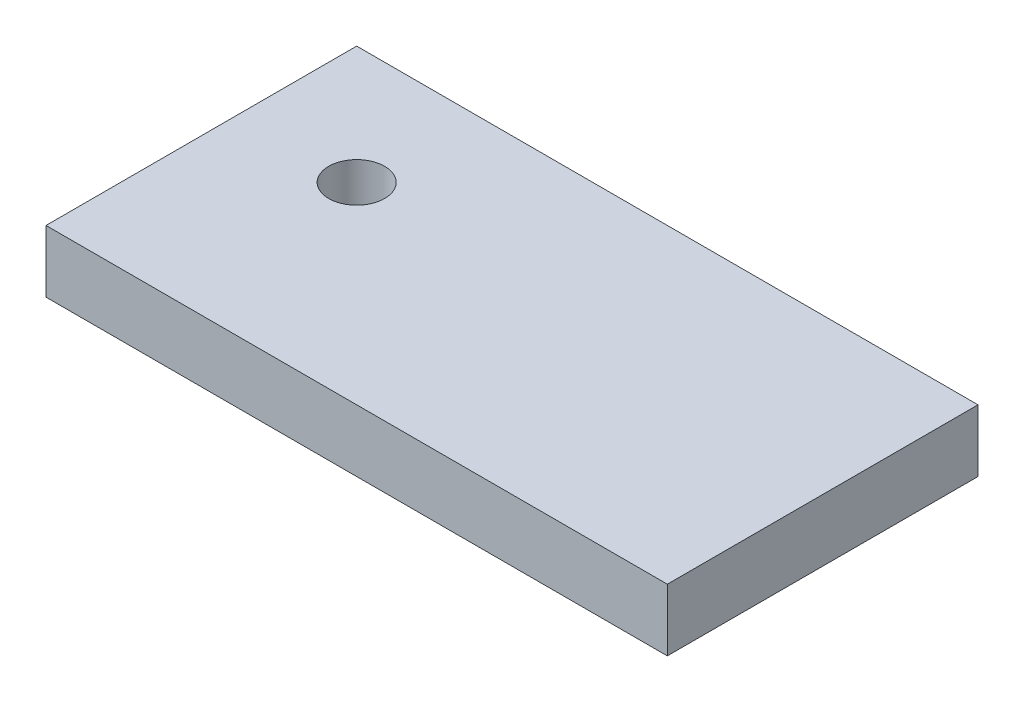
from build123d import *

# Parameters (mm, degrees)
SKETCH1_W                = 100
SKETCH1_H                = 50
EXTRUDE1_DEPTH           = 10
F_9_DIAMETER_HOLE1_D     = 9
F_9_DIAMETER_HOLE1_DEPTH = 10
F_9_DIAMETER_HOLE1_TIP   = 2.703872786


with BuildPart() as part:
    # Sketch1 → Extrude1 (new body)
    with BuildSketch(Plane(origin=(0, 0, 0), x_dir=(1, 0, 0), z_dir=(0, 1, 0))):
        with Locations((50, 25)):
            Rectangle(SKETCH1_W, SKETCH1_H)
    extrude(amount=EXTRUDE1_DEPTH)

    # 9_ Diameter Hole1
    with Locations(Plane(origin=(19, 10, -31), x_dir=(0, 0, 1), z_dir=(0, 1, 0))):
        with Locations((0, 0)):
            Hole(F_9_DIAMETER_HOLE1_D / 2, depth=F_9_DIAMETER_HOLE1_DEPTH)
            with Locations((0, 0, -(F_9_DIAMETER_HOLE1_DEPTH + F_9_DIAMETER_HOLE1_TIP / 2))):  # 118° drill point
                Cone(0, F_9_DIAMETER_HOLE1_D / 2, F_9_DIAMETER_HOLE1_TIP, mode=Mode.SUBTRACT)


solid = part.part
